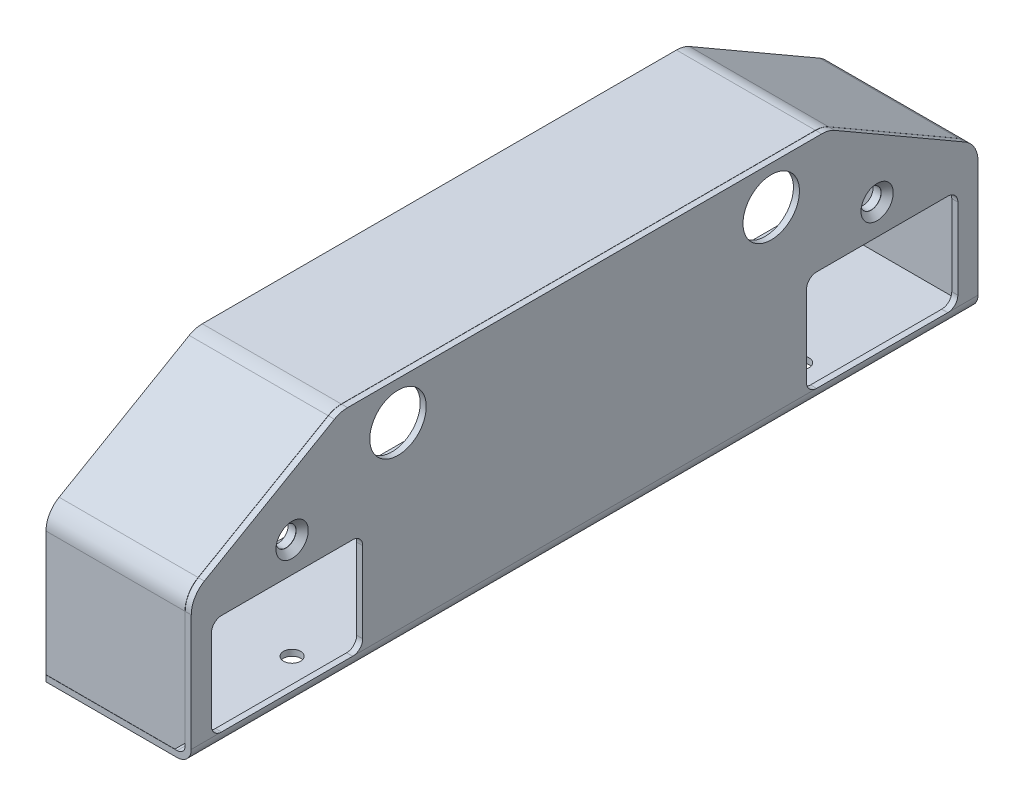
from build123d import *

# Parameters (mm, degrees)
EXTRUSION1_DEPTH         = 195
ESQUISSE4_R              = 14
ENL_V_MAT_EXTRU_3_DEPTH  = 4
ENL_V_MAT_EXTRU_5_DEPTH  = 3
ENL_V_MAT_EXTRU_6_DEPTH  = 3
ENL_V_MAT_EXTRU_8_DEPTH  = 3
CONG_2_R                 = 13
EXTRUSION2_DEPTH         = 68.9
CHANFREIN4_SIZE          = 5
ESQUISSE12_R             = 4.25
ENL_V_MAT_EXTRU_9_DEPTH  = 5
ESQUISSE13_R             = 4.25
ENL_V_MAT_EXTRU_10_DEPTH = 5
EXTRUSION3_START         = 0.1
ESQUISSE15_W             = 305
ESQUISSE15_H             = 15
ESQUISSE15_R             = 5
EXTRUSION3_DEPTH         = 3.9
EXTRUSION4_DEPTH         = 3
EXTRUSION4_2_DEPTH       = 3


with BuildPart() as part:
    # Esquisse1 → Extrusion1 (new, symmetric)
    with BuildSketch(Plane.XY):
        with BuildLine():
            Line((0, 0), (0, -108))
            ThreePointArc((0, -108), (-1.171572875, -110.828427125), (-4, -112))
            Line((-4, -112), (-69, -112))
            Line((-69, -112), (-69, -115))
            Line((-69, -115), (-4, -115))
            ThreePointArc((-4, -115), (0.949747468, -112.949747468), (3, -108))
            Line((3, -108), (3, 0))
            Line((3, 0), (0, 0))
        make_face()
    extrude(amount=EXTRUSION1_DEPTH, both=True)

    # Esquisse4 → Enl_v. mat.-Extru.3 (cut)
    with BuildSketch(Plane(origin=(3, 0, 0), x_dir=(0, 0, -1), z_dir=(1, 0, 0))):
        with Locations(Location((92.5, -19, 0), (0, 0, 90))):
            Circle(ESQUISSE4_R)
        with Locations(Location((-92.5, -19, 0), (0, 0, 90))):
            Circle(ESQUISSE4_R)
    extrude(amount=-ENL_V_MAT_EXTRU_3_DEPTH, mode=Mode.SUBTRACT)

    # Esquisse6 → Enl_v. mat.-Extru.5 (cut)
    with BuildSketch(Plane.XZ.offset(115)):
        with BuildLine():
            Line((-55, 14), (-69, 28))
            Line((-69, 28), (-69, -28))
            Line((-69, -28), (-55, -14))
            ThreePointArc((-55, -14), (-41, 0), (-55, 14))
        make_face()
    extrude(amount=-ENL_V_MAT_EXTRU_5_DEPTH, mode=Mode.SUBTRACT)

    # Esquisse7 → Enl_v. mat.-Extru.6 (cut)
    with BuildSketch(Plane(origin=(3, 0, 0), x_dir=(0, 0, -1), z_dir=(1, 0, 0))):
        with BuildLine():
            Line((-180, -108), (-115, -108))
            ThreePointArc((-115, -108), (-111.464466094, -106.535533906), (-110, -103))
            Line((-110, -103), (-110, -63))
            ThreePointArc((-110, -63), (-111.464466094, -59.464466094), (-115, -58))
            Line((-115, -58), (-180, -58))
            ThreePointArc((-180, -58), (-183.535533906, -59.464466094), (-185, -63))
            Line((-185, -63), (-185, -103))
            ThreePointArc((-185, -103), (-183.535533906, -106.535533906), (-180, -108))
        make_face()
        with BuildLine():
            Line((115, -108), (180, -108))
            ThreePointArc((180, -108), (183.535533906, -106.535533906), (185, -103))
            Line((185, -103), (185, -63))
            ThreePointArc((185, -63), (183.535533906, -59.464466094), (180, -58))
            Line((180, -58), (115, -58))
            ThreePointArc((115, -58), (111.464466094, -59.464466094), (110, -63))
            Line((110, -63), (110, -103))
            ThreePointArc((110, -103), (111.464466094, -106.535533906), (115, -108))
        make_face()
    extrude(amount=-ENL_V_MAT_EXTRU_6_DEPTH, mode=Mode.SUBTRACT)

    # Esquisse10 → Enl_v. mat.-Extru.8 (cut)
    with BuildSketch(Plane(origin=(3, 0, 0), x_dir=(0, 0, -1), z_dir=(1, 0, 0))):
        Polygon((-195, -42.72391992), (-121, 0), (-195, 0), align=None)
        Polygon((121, 0), (195, 0), (195, -42.72391992), align=None)
    extrude(amount=-ENL_V_MAT_EXTRU_8_DEPTH, mode=Mode.SUBTRACT)

    # Cong_2
    cong_2_edges = [part.edges().sort_by_distance(p)[0] for p in [
        (1.5, -42.72391992, 195),
        (1.5, 0, 121),
        (1.5, -42.72391992, -195),
        (1.5, 0, -121),
    ]]
    fillet(cong_2_edges, radius=CONG_2_R)

    # Esquisse12 → Enl_v. mat.-Extru.9 (cut)
    with BuildSketch(Plane(origin=(3, 0, 0), x_dir=(0, 0, -1), z_dir=(1, 0, 0))):
        with Locations(Location((-145, -43, 0), (0, 0, 90))):
            Circle(ESQUISSE12_R)
        with Locations(Location((145, -43, 0), (0, 0, 90))):
            Circle(ESQUISSE12_R)
    extrude(amount=-ENL_V_MAT_EXTRU_9_DEPTH, mode=Mode.SUBTRACT)

    # Esquisse13 → Enl_v. mat.-Extru.10 (cut)
    with BuildSketch(Plane.XZ.offset(115)):
        with Locations((-16, 126)):
            Circle(ESQUISSE13_R)
        with Locations((-16, -126)):
            Circle(ESQUISSE13_R)
        with Locations((-57, 62.5)):
            Circle(ESQUISSE13_R)
        with Locations((-57, -62.5)):
            Circle(ESQUISSE13_R)
    extrude(amount=-ENL_V_MAT_EXTRU_10_DEPTH, mode=Mode.SUBTRACT)

    # Esquisse14 → Enl_vement de mati_re-R_volution1 (revolve, cut)
    with BuildSketch(Plane(origin=(0, -43, 0), x_dir=(-1, 0, 0), z_dir=(0, 1, 0)), mode=Mode.PRIVATE) as enl_vement_de_mati_re_r_volution1_sk:
        Polygon((-3, 145), (-3, 153), (5, 145), align=None)
    enl_vement_de_mati_re_r_volution1 = revolve(enl_vement_de_mati_re_r_volution1_sk.sketch.rotate(Axis((14.359571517, -43, 145), (-1, 0, 0)), 180), axis=Axis((14.359571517, -43, 145), (-1, 0, 0)), mode=Mode.SUBTRACT)

    # Sym_trie1: Enl_vement de mati_re-R_volution1 across plane
    add(enl_vement_de_mati_re_r_volution1.mirror(Plane.XY), mode=Mode.SUBTRACT)


with BuildPart() as body_2:
    # Esquisse11 → Extrusion2 (new body)
    with BuildSketch(Plane.ZY.offset(69)):
        with BuildLine():
            Line((195, -111.9), (195, -50.229473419))
            ThreePointArc((195, -50.229473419), (193.258330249, -43.729473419), (188.5, -38.97114317))
            Line((188.5, -38.97114317), (124.016660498, -1.741669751))
            ThreePointArc((124.016660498, -1.741669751), (120.881308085, -0.442964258), (117.516660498, 0))
            Line((117.516660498, 0), (-117.516660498, 0))
            ThreePointArc((-117.516660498, 0), (-120.881308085, -0.442964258), (-124.016660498, -1.741669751))
            Line((-124.016660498, -1.741669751), (-188.5, -38.97114317))
            ThreePointArc((-188.5, -38.97114317), (-193.258330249, -43.729473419), (-195, -50.229473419))
            Line((-195, -50.229473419), (-195, -111.9))
            Line((-195, -111.9), (-192, -111.9))
            Line((-192, -111.9), (-192, -50.229473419))
            ThreePointArc((-192, -50.229473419), (-190.660254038, -45.229473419), (-187, -41.569219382))
            Line((-187, -41.569219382), (-122.516660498, -4.339745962))
            ThreePointArc((-122.516660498, -4.339745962), (-120.104850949, -3.340741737), (-117.516660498, -3))
            Line((-117.516660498, -3), (117.516660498, -3))
            ThreePointArc((117.516660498, -3), (120.104850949, -3.340741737), (122.516660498, -4.339745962))
            Line((122.516660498, -4.339745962), (187, -41.569219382))
            ThreePointArc((187, -41.569219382), (190.660254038, -45.229473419), (192, -50.229473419))
            Line((192, -50.229473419), (192, -111.9))
            Line((192, -111.9), (195, -111.9))
        make_face()
    extrude(amount=-EXTRUSION2_DEPTH)

    # Chanfrein4
    chanfrein4_edges = [body_2.edges().sort_by_distance(p)[0] for p in [
        (-0.1, -111.9, -193.5),
        (-0.1, -111.9, 193.5),
    ]]
    chamfer(chanfrein4_edges, length=CHANFREIN4_SIZE)


with BuildPart() as body_3:
    # Esquisse15 → Extrusion3 (new body)
    with BuildSketch(Plane.ZY.offset(EXTRUSION3_START)):
        with Locations((0, -43)):
            Rectangle(ESQUISSE15_W, ESQUISSE15_H)
        with Locations(Location((-145, -43, 0), (0, 0, 270))):
            Circle(ESQUISSE15_R, mode=Mode.SUBTRACT)
        with Locations(Location((145, -43, 0), (0, 0, 270))):
            Circle(ESQUISSE15_R, mode=Mode.SUBTRACT)
    extrude(amount=EXTRUSION3_DEPTH)


with BuildPart() as body_4:
    # Esquisse16 → Extrusion4 (new body)
    with BuildSketch(Plane.ZY.offset(69)):
        with BuildLine():
            Line((122.466660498, -4.426348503), (186.9, -41.626954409))
            ThreePointArc((186.9, -41.626954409), (190.560254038, -45.287208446), (191.9, -50.287208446))
            Line((191.9, -50.287208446), (191.9, -54.790540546))
            Line((191.9, -54.790540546), (102.369357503, -3.1))
            Line((102.369357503, -3.1), (117.516660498, -3.1))
            ThreePointArc((117.516660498, -3.1), (120.078969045, -3.43733432), (122.466660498, -4.426348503))
        make_face()
    extrude(amount=-EXTRUSION4_DEPTH)


with BuildPart() as body_5:
    # Esquisse16 → Extrusion4 2 (new body)
    with BuildSketch(Plane.ZY.offset(69)):
        with BuildLine():
            Line((-191.9, -54.790540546), (-191.9, -50.287208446))
            ThreePointArc((-191.9, -50.287208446), (-190.560254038, -45.287208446), (-186.9, -41.626954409))
            Line((-186.9, -41.626954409), (-122.466660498, -4.426348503))
            ThreePointArc((-122.466660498, -4.426348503), (-120.078969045, -3.43733432), (-117.516660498, -3.1))
            Line((-117.516660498, -3.1), (-102.369357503, -3.1))
            Line((-102.369357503, -3.1), (-191.9, -54.790540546))
        make_face()
    extrude(amount=-EXTRUSION4_2_DEPTH)


solid = Compound([part.part, body_2.part, body_3.part, body_4.part, body_5.part])
